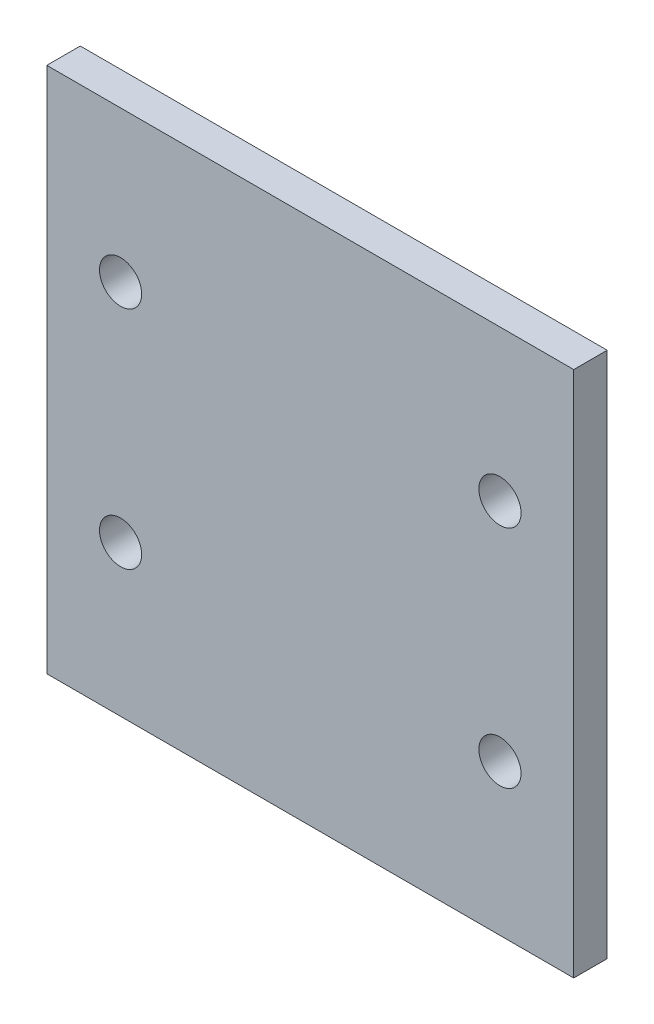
from build123d import *

# Parameters (mm, degrees)
ESQUISSE1_W        = 25
ESQUISSE1_H        = 25
ESQUISSE1_R        = 1
BOSS_EXTRU_1_DEPTH = 1.5875


with BuildPart() as part:
    # Esquisse1 → Boss.-Extru.1 (new body)
    with BuildSketch(Plane.XY):
        Rectangle(ESQUISSE1_W, ESQUISSE1_H)
        with Locations((-9, 5.35)):
            Circle(ESQUISSE1_R, mode=Mode.SUBTRACT)
        with Locations((9, 5.35)):
            Circle(ESQUISSE1_R, mode=Mode.SUBTRACT)
        with Locations((-9, -5.35)):
            Circle(ESQUISSE1_R, mode=Mode.SUBTRACT)
        with Locations((9, -5.35)):
            Circle(ESQUISSE1_R, mode=Mode.SUBTRACT)
    extrude(amount=BOSS_EXTRU_1_DEPTH)


solid = part.part
